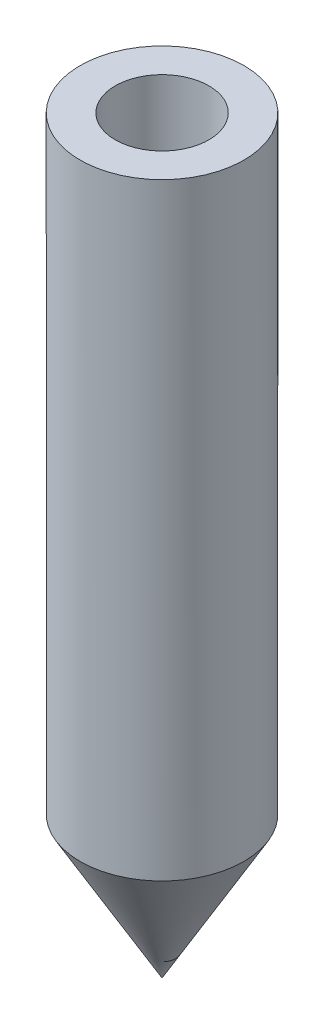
from build123d import *

# Parameters (mm, degrees)
SKETCH1_R           = 2.0828
BOSS_EXTRUDE1_DEPTH = 19.05
CHAMFER1_SIZE       = 2.0828
CHAMFER1_SIZE2      = 3.607515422
SKETCH4_R           = 1.190625
CUT_EXTRUDE1_DEPTH  = 3.175
CHAMFER2_SIZE       = 1.190625


with BuildPart() as part:
    # Sketch1 → Boss-Extrude1 (new body)
    with BuildSketch(Plane(origin=(0, 0, 0), x_dir=(1, 0, 0), z_dir=(0, 1, 0))):
        with Locations(Location((0, 0, 0), (0, 0, 90))):
            Circle(SKETCH1_R)
    extrude(amount=BOSS_EXTRUDE1_DEPTH)

    # Chamfer1
    chamfer1_edges = [part.edges().sort_by_distance(p)[0] for p in [
        (0, 0, 2.0828),
    ]]
    chamfer1_side = [part.faces().sort_by_distance(p)[0] for p in [
        (0, 0, 0),
    ]]
    chamfer(chamfer1_edges, length=CHAMFER1_SIZE, length2=CHAMFER1_SIZE2, reference=chamfer1_side[0])

    # Sketch4 → Cut-Extrude1 (cut)
    with BuildSketch(Plane(origin=(0, 19.05, 0), x_dir=(1, 0, 0), z_dir=(0, 1, 0))):
        with Locations(Location((0, 0, 0), (0, 0, 270))):
            Circle(SKETCH4_R)
    extrude(amount=-CUT_EXTRUDE1_DEPTH, mode=Mode.SUBTRACT)

    # Chamfer2
    chamfer2_edges = [part.edges().sort_by_distance(p)[0] for p in [
        (0, 15.875, -1.190625),
    ]]
    chamfer(chamfer2_edges, length=CHAMFER2_SIZE)


solid = part.part
